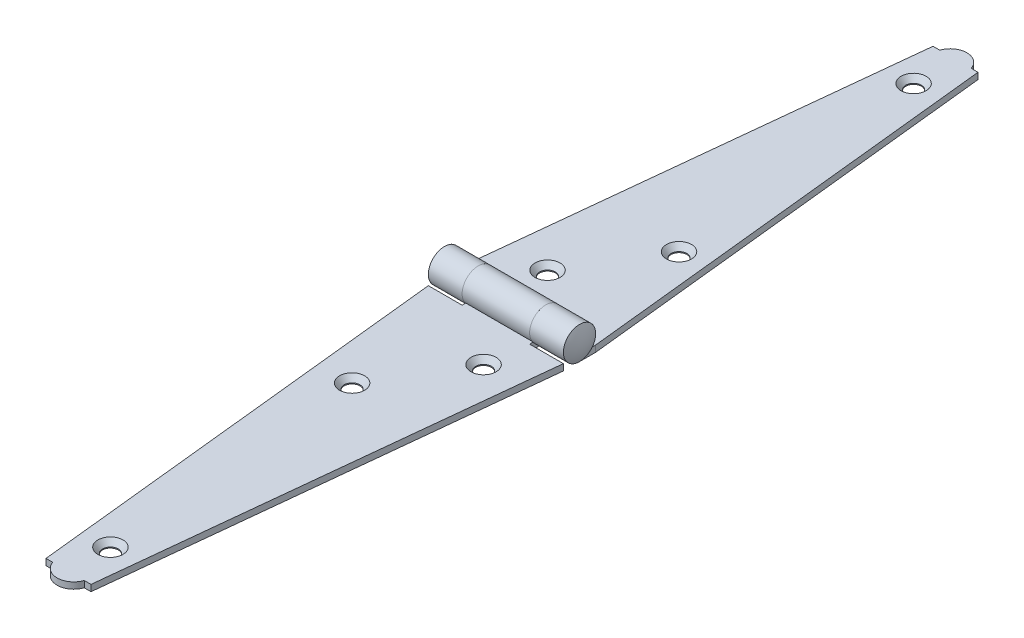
ISO-10303-21;
HEADER;
FILE_DESCRIPTION(('STEP AP214'),'2;1');
FILE_NAME('part.step','',(''),(''),'','','');
FILE_SCHEMA(('AUTOMOTIVE_DESIGN { 1 0 10303 214 1 1 1 1 }'));
ENDSEC;
DATA;
#1=APPLICATION_CONTEXT('core data for automotive mechanical design processes');
#2=APPLICATION_PROTOCOL_DEFINITION('international standard','automotive_design',2000,#1);
#3=PRODUCT_CONTEXT('',#1,'mechanical');
#4=PRODUCT('Part','Part','',(#3));
#5=PRODUCT_RELATED_PRODUCT_CATEGORY('part','',(#4));
#6=PRODUCT_DEFINITION_FORMATION('','',#4);
#7=PRODUCT_DEFINITION_CONTEXT('part definition',#1,'design');
#8=PRODUCT_DEFINITION('design','',#6,#7);
#9=PRODUCT_DEFINITION_SHAPE('','',#8);
#10=(LENGTH_UNIT() NAMED_UNIT(*) SI_UNIT(.MILLI.,.METRE.));
#11=(NAMED_UNIT(*) PLANE_ANGLE_UNIT() SI_UNIT($,.RADIAN.));
#12=(NAMED_UNIT(*) SI_UNIT($,.STERADIAN.) SOLID_ANGLE_UNIT());
#13=UNCERTAINTY_MEASURE_WITH_UNIT(LENGTH_MEASURE(1.E-05),#10,'distance_accuracy_value','');
#14=(GEOMETRIC_REPRESENTATION_CONTEXT(3) GLOBAL_UNCERTAINTY_ASSIGNED_CONTEXT((#13)) GLOBAL_UNIT_ASSIGNED_CONTEXT((#10,
#11,#12)) REPRESENTATION_CONTEXT('',''));
#15=CARTESIAN_POINT('',(0.,0.,0.));
#16=DIRECTION('',(0.,0.,1.));
#17=DIRECTION('',(1.,0.,0.));
#18=AXIS2_PLACEMENT_3D('',#15,#16,#17);
#19=CARTESIAN_POINT('',(6.93366917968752,3.60521250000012,0.));
#20=DIRECTION('',(1.,0.,0.));
#21=DIRECTION('',(0.,0.,1.));
#22=AXIS2_PLACEMENT_3D('',#19,#20,#21);
#23=SPHERICAL_SURFACE('',#22,8.90958082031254);
#24=CARTESIAN_POINT('',(15.0812499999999,3.60521249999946,-1.11022302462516E-13));
#25=DIRECTION('',(1.,0.,0.));
#26=DIRECTION('',(0.,0.,-1.));
#27=AXIS2_PLACEMENT_3D('',#24,#25,#26);
#28=CIRCLE('',#27,3.60521250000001);
#29=CARTESIAN_POINT('',(15.0812499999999,3.60521249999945,-3.60521250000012));
#30=VERTEX_POINT('',#29);
#31=EDGE_CURVE('E11',#30,#30,#28,.T.);
#32=ORIENTED_EDGE('',*,*,#31,.T.);
#33=EDGE_LOOP('',(#32));
#34=FACE_BOUND('',#33,.T.);
#35=ADVANCED_FACE('F41',(#34),#23,.T.);
#36=CARTESIAN_POINT('',(15.0812499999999,3.60521250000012,-3.60521249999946));
#37=DIRECTION('',(-1.,0.,0.));
#38=DIRECTION('',(0.,0.,1.));
#39=AXIS2_PLACEMENT_3D('',#36,#37,#38);
#40=PLANE('',#39);
#41=CARTESIAN_POINT('',(15.0812499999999,3.60521249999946,-1.11022302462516E-13));
#42=DIRECTION('',(1.,0.,0.));
#43=DIRECTION('',(0.,0.,-1.));
#44=AXIS2_PLACEMENT_3D('',#41,#42,#43);
#45=CIRCLE('',#44,2.18281249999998);
#46=CARTESIAN_POINT('',(15.0812499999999,3.60521249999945,-2.18281250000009));
#47=VERTEX_POINT('',#46);
#48=EDGE_CURVE('E47',#47,#47,#45,.T.);
#49=ORIENTED_EDGE('',*,*,#48,.T.);
#50=EDGE_LOOP('',(#49));
#51=FACE_BOUND('',#50,.T.);
#52=ORIENTED_EDGE('',*,*,#31,.F.);
#53=EDGE_LOOP('',(#52));
#54=FACE_BOUND('',#53,.T.);
#55=ADVANCED_FACE('F73',(#51,#54),#40,.T.);
#56=CARTESIAN_POINT('',(15.8432500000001,3.60521250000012,0.));
#57=DIRECTION('',(1.,0.,0.));
#58=DIRECTION('',(0.,0.,-1.));
#59=AXIS2_PLACEMENT_3D('',#56,#57,#58);
#60=CYLINDRICAL_SURFACE('',#59,2.18281249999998);
#61=CARTESIAN_POINT('',(-15.0812499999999,3.60521250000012,0.));
#62=DIRECTION('',(1.,0.,0.));
#63=DIRECTION('',(0.,0.,-1.));
#64=AXIS2_PLACEMENT_3D('',#61,#62,#63);
#65=CIRCLE('',#64,2.18281249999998);
#66=CARTESIAN_POINT('',(-15.0812499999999,3.60521250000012,-2.18281249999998));
#67=VERTEX_POINT('',#66);
#68=EDGE_CURVE('E51',#67,#67,#65,.T.);
#69=ORIENTED_EDGE('',*,*,#68,.T.);
#70=EDGE_LOOP('',(#69));
#71=FACE_BOUND('',#70,.T.);
#72=ORIENTED_EDGE('',*,*,#48,.F.);
#73=EDGE_LOOP('',(#72));
#74=FACE_BOUND('',#73,.T.);
#75=ADVANCED_FACE('F70',(#71,#74),#60,.T.);
#76=CARTESIAN_POINT('',(-15.0812499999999,3.60521250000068,-2.18281249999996));
#77=DIRECTION('',(1.,0.,0.));
#78=DIRECTION('',(0.,0.,-1.));
#79=AXIS2_PLACEMENT_3D('',#76,#77,#78);
#80=PLANE('',#79);
#81=CARTESIAN_POINT('',(-15.0812499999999,3.60521250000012,0.));
#82=DIRECTION('',(1.,0.,0.));
#83=DIRECTION('',(0.,0.,-1.));
#84=AXIS2_PLACEMENT_3D('',#81,#82,#83);
#85=CIRCLE('',#84,3.6052125);
#86=CARTESIAN_POINT('',(-15.0812499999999,3.60521250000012,-3.60521250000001));
#87=VERTEX_POINT('',#86);
#88=EDGE_CURVE('E55',#87,#87,#85,.T.);
#89=ORIENTED_EDGE('',*,*,#88,.T.);
#90=EDGE_LOOP('',(#89));
#91=FACE_BOUND('',#90,.T.);
#92=ORIENTED_EDGE('',*,*,#68,.F.);
#93=EDGE_LOOP('',(#92));
#94=FACE_BOUND('',#93,.T.);
#95=ADVANCED_FACE('F61',(#91,#94),#80,.T.);
#96=CARTESIAN_POINT('',(-6.93366917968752,3.60521249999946,-1.11022302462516E-13));
#97=DIRECTION('',(1.,0.,0.));
#98=DIRECTION('',(0.,0.,-1.));
#99=AXIS2_PLACEMENT_3D('',#96,#97,#98);
#100=SPHERICAL_SURFACE('',#99,8.90958082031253);
#101=ORIENTED_EDGE('',*,*,#88,.F.);
#102=EDGE_LOOP('',(#101));
#103=FACE_BOUND('',#102,.T.);
#104=ADVANCED_FACE('F64',(#103),#100,.T.);
#105=CLOSED_SHELL('',(#35,#55,#75,#95,#104));
#106=MANIFOLD_SOLID_BREP('B2',#105);
#107=CARTESIAN_POINT('',(120.533262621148,3.60521250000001,3.33066907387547E-13));
#108=DIRECTION('',(-1.,0.,0.));
#109=DIRECTION('',(0.,0.,1.));
#110=AXIS2_PLACEMENT_3D('',#107,#108,#109);
#111=CYLINDRICAL_SURFACE('',#110,3.60521250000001);
#112=CARTESIAN_POINT('',(-7.54062500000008,3.6052124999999,1.11022302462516E-13));
#113=DIRECTION('',(1.,0.,0.));
#114=DIRECTION('',(0.,0.,-1.));
#115=AXIS2_PLACEMENT_3D('',#112,#113,#114);
#116=CIRCLE('',#115,3.60521250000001);
#117=CARTESIAN_POINT('',(-7.54062500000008,1.67639999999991,-3.04585612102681));
#118=VERTEX_POINT('',#117);
#119=CARTESIAN_POINT('',(-7.54062500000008,0.,0.));
#120=VERTEX_POINT('',#119);
#121=EDGE_CURVE('E295',#118,#120,#116,.T.);
#122=ORIENTED_EDGE('',*,*,#121,.F.);
#123=DIRECTION('',(-1.,0.,0.));
#124=VECTOR('',#123,1.);
#125=CARTESIAN_POINT('',(120.533262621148,1.67639999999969,-3.04585612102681));
#126=LINE('',#125,#124);
#127=CARTESIAN_POINT('',(-15.0812499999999,1.67639999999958,-3.04585612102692));
#128=VERTEX_POINT('',#127);
#129=EDGE_CURVE('E311',#118,#128,#126,.T.);
#130=ORIENTED_EDGE('',*,*,#129,.T.);
#131=CARTESIAN_POINT('',(-15.0812499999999,3.60521250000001,0.));
#132=DIRECTION('',(1.,0.,0.));
#133=DIRECTION('',(0.,0.,-1.));
#134=AXIS2_PLACEMENT_3D('',#131,#132,#133);
#135=CIRCLE('',#134,3.60521250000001);
#136=CARTESIAN_POINT('',(-15.0812499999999,-3.33066907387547E-13,1.11022302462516E-13));
#137=VERTEX_POINT('',#136);
#138=EDGE_CURVE('E306',#137,#128,#135,.F.);
#139=ORIENTED_EDGE('',*,*,#138,.F.);
#140=DIRECTION('',(-1.,0.,0.));
#141=VECTOR('',#140,1.);
#142=CARTESIAN_POINT('',(120.533262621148,-2.22044604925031E-13,6.66133814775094E-13));
#143=LINE('',#142,#141);
#144=EDGE_CURVE('E332',#120,#137,#143,.T.);
#145=ORIENTED_EDGE('',*,*,#144,.F.);
#146=EDGE_LOOP('',(#122,#130,#139,#145));
#147=FACE_BOUND('',#146,.T.);
#148=ADVANCED_FACE('F110',(#147),#111,.T.);
#149=CARTESIAN_POINT('',(15.0812499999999,1.67639999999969,-3.0458561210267));
#150=VERTEX_POINT('',#149);
#151=CARTESIAN_POINT('',(7.54062500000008,1.6763999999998,-3.0458561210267));
#152=VERTEX_POINT('',#151);
#153=EDGE_CURVE('E339',#150,#152,#126,.T.);
#154=ORIENTED_EDGE('',*,*,#153,.T.);
#155=CARTESIAN_POINT('',(7.54062500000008,3.60521250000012,0.));
#156=DIRECTION('',(-1.,0.,0.));
#157=DIRECTION('',(0.,0.,1.));
#158=AXIS2_PLACEMENT_3D('',#155,#156,#157);
#159=CIRCLE('',#158,3.60521250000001);
#160=CARTESIAN_POINT('',(7.54062500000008,-5.55111512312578E-13,2.22044604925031E-13));
#161=VERTEX_POINT('',#160);
#162=EDGE_CURVE('E133',#161,#152,#159,.T.);
#163=ORIENTED_EDGE('',*,*,#162,.F.);
#164=CARTESIAN_POINT('',(15.0812499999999,-5.55111512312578E-13,1.11022302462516E-13));
#165=VERTEX_POINT('',#164);
#166=EDGE_CURVE('E328',#165,#161,#143,.T.);
#167=ORIENTED_EDGE('',*,*,#166,.F.);
#168=CARTESIAN_POINT('',(15.0812499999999,3.60521250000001,0.));
#169=DIRECTION('',(1.,0.,0.));
#170=DIRECTION('',(0.,0.,-1.));
#171=AXIS2_PLACEMENT_3D('',#168,#169,#170);
#172=CIRCLE('',#171,3.60521250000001);
#173=EDGE_CURVE('E321',#150,#165,#172,.T.);
#174=ORIENTED_EDGE('',*,*,#173,.F.);
#175=EDGE_LOOP('',(#154,#163,#167,#174));
#176=FACE_BOUND('',#175,.T.);
#177=ADVANCED_FACE('F382',(#176),#111,.T.);
#178=CARTESIAN_POINT('',(120.533262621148,-2.22044604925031E-13,6.66133814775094E-13));
#179=DIRECTION('',(0.,1.,0.));
#180=DIRECTION('',(0.,0.,1.));
#181=AXIS2_PLACEMENT_3D('',#178,#179,#180);
#182=PLANE('',#181);
#183=CARTESIAN_POINT('',(-6.66133814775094E-13,0.,-89.69375));
#184=DIRECTION('',(0.,1.,0.));
#185=DIRECTION('',(0.,0.,1.));
#186=AXIS2_PLACEMENT_3D('',#183,#184,#185);
#187=CIRCLE('',#186,1.7526);
#188=CARTESIAN_POINT('',(-6.62558805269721E-13,0.,-87.94115));
#189=VERTEX_POINT('',#188);
#190=EDGE_CURVE('E235',#189,#189,#187,.T.);
#191=ORIENTED_EDGE('',*,*,#190,.T.);
#192=EDGE_LOOP('',(#191));
#193=FACE_BOUND('',#192,.T.);
#194=CARTESIAN_POINT('',(6.35000000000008,-3.33066907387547E-13,-30.95625));
#195=DIRECTION('',(0.,1.,0.));
#196=DIRECTION('',(0.,0.,1.));
#197=AXIS2_PLACEMENT_3D('',#194,#195,#196);
#198=CIRCLE('',#197,1.7526);
#199=CARTESIAN_POINT('',(6.35000000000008,-3.317535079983E-13,-29.20365));
#200=VERTEX_POINT('',#199);
#201=EDGE_CURVE('E472',#200,#200,#198,.T.);
#202=ORIENTED_EDGE('',*,*,#201,.T.);
#203=EDGE_LOOP('',(#202));
#204=FACE_BOUND('',#203,.T.);
#205=CARTESIAN_POINT('',(-4.7625,1.11022302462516E-13,-12.6999999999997));
#206=DIRECTION('',(0.,1.,0.));
#207=DIRECTION('',(0.,0.,1.));
#208=AXIS2_PLACEMENT_3D('',#205,#206,#207);
#209=CIRCLE('',#208,1.7526);
#210=CARTESIAN_POINT('',(-4.7625,1.12335701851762E-13,-10.9473999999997));
#211=VERTEX_POINT('',#210);
#212=EDGE_CURVE('E474',#211,#211,#209,.T.);
#213=ORIENTED_EDGE('',*,*,#212,.T.);
#214=EDGE_LOOP('',(#213));
#215=FACE_BOUND('',#214,.T.);
#216=DIRECTION('',(0.,0.,1.));
#217=VECTOR('',#216,1.);
#218=CARTESIAN_POINT('',(-15.0812499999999,-3.33066907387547E-13,1.11022302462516E-13));
#219=LINE('',#218,#217);
#220=CARTESIAN_POINT('',(-15.0812499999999,-3.33066907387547E-13,-3.60521249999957));
#221=VERTEX_POINT('',#220);
#222=EDGE_CURVE('E309',#221,#137,#219,.T.);
#223=ORIENTED_EDGE('',*,*,#222,.F.);
#224=DIRECTION('',(0.104749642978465,0.,-0.994498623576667));
#225=VECTOR('',#224,1.);
#226=CARTESIAN_POINT('',(-13.9687885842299,0.,-14.1669797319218));
#227=LINE('',#226,#225);
#228=CARTESIAN_POINT('',(-5.0270833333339,-4.44089209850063E-13,-99.0599999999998));
#229=VERTEX_POINT('',#228);
#230=EDGE_CURVE('E125',#221,#229,#227,.T.);
#231=ORIENTED_EDGE('',*,*,#230,.T.);
#232=DIRECTION('',(1.,0.,0.));
#233=VECTOR('',#232,1.);
#234=CARTESIAN_POINT('',(120.533262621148,-1.11022302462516E-13,-99.06));
#235=LINE('',#234,#233);
#236=CARTESIAN_POINT('',(-3.51895833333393,-3.33066907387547E-13,-99.06));
#237=VERTEX_POINT('',#236);
#238=EDGE_CURVE('E270',#229,#237,#235,.T.);
#239=ORIENTED_EDGE('',*,*,#238,.T.);
#240=CARTESIAN_POINT('',(-6.66133814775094E-13,-6.66133814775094E-13,-97.8923882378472));
#241=DIRECTION('',(0.,1.,0.));
#242=DIRECTION('',(0.,0.,1.));
#243=AXIS2_PLACEMENT_3D('',#240,#241,#242);
#244=CIRCLE('',#243,3.70761176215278);
#245=CARTESIAN_POINT('',(3.51895833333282,0.,-99.0599999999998));
#246=VERTEX_POINT('',#245);
#247=EDGE_CURVE('E267',#237,#246,#244,.F.);
#248=ORIENTED_EDGE('',*,*,#247,.T.);
#249=DIRECTION('',(1.,0.,0.));
#250=VECTOR('',#249,1.);
#251=CARTESIAN_POINT('',(120.533262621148,-1.11022302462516E-13,-99.06));
#252=LINE('',#251,#250);
#253=CARTESIAN_POINT('',(5.02708333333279,-3.33066907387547E-13,-99.06));
#254=VERTEX_POINT('',#253);
#255=EDGE_CURVE('E244',#246,#254,#252,.T.);
#256=ORIENTED_EDGE('',*,*,#255,.T.);
#257=DIRECTION('',(0.104749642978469,0.,0.994498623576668));
#258=VECTOR('',#257,1.);
#259=CARTESIAN_POINT('',(16.6138880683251,-4.44089209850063E-13,10.9457339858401));
#260=LINE('',#259,#258);
#261=CARTESIAN_POINT('',(15.0812499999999,-5.55111512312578E-13,-3.60521249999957));
#262=VERTEX_POINT('',#261);
#263=EDGE_CURVE('E264',#254,#262,#260,.T.);
#264=ORIENTED_EDGE('',*,*,#263,.T.);
#265=DIRECTION('',(0.,0.,-1.));
#266=VECTOR('',#265,1.);
#267=CARTESIAN_POINT('',(15.0812499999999,-5.55111512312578E-13,1.11022302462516E-13));
#268=LINE('',#267,#266);
#269=EDGE_CURVE('E318',#165,#262,#268,.T.);
#270=ORIENTED_EDGE('',*,*,#269,.F.);
#271=ORIENTED_EDGE('',*,*,#166,.T.);
#272=DIRECTION('',(0.,0.,-1.));
#273=VECTOR('',#272,1.);
#274=CARTESIAN_POINT('',(7.54062500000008,-2.22044604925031E-13,-3.60521249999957));
#275=LINE('',#274,#273);
#276=CARTESIAN_POINT('',(7.54062500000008,-2.22044604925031E-13,-3.60521249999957));
#277=VERTEX_POINT('',#276);
#278=EDGE_CURVE('E276',#161,#277,#275,.T.);
#279=ORIENTED_EDGE('',*,*,#278,.T.);
#280=DIRECTION('',(-1.,0.,0.));
#281=VECTOR('',#280,1.);
#282=CARTESIAN_POINT('',(-7.54062500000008,-4.44089209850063E-13,-3.60521249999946));
#283=LINE('',#282,#281);
#284=CARTESIAN_POINT('',(-7.54062500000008,-4.44089209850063E-13,-3.60521249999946));
#285=VERTEX_POINT('',#284);
#286=EDGE_CURVE('E279',#277,#285,#283,.T.);
#287=ORIENTED_EDGE('',*,*,#286,.T.);
#288=DIRECTION('',(0.,0.,1.));
#289=VECTOR('',#288,1.);
#290=CARTESIAN_POINT('',(-7.54062500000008,-4.44089209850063E-13,-3.60521249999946));
#291=LINE('',#290,#289);
#292=EDGE_CURVE('E273',#285,#120,#291,.T.);
#293=ORIENTED_EDGE('',*,*,#292,.T.);
#294=ORIENTED_EDGE('',*,*,#144,.T.);
#295=EDGE_LOOP('',(#223,#231,#239,#248,#256,#264,#270,#271,#279,#287,#293,#294));
#296=FACE_BOUND('',#295,.T.);
#297=ADVANCED_FACE('F388',(#193,#204,#215,#296),#182,.F.);
#298=CARTESIAN_POINT('',(120.533262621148,1.42240000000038,-101.6));
#299=DIRECTION('',(0.,-1.,0.));
#300=DIRECTION('',(0.,0.,-1.));
#301=AXIS2_PLACEMENT_3D('',#298,#299,#300);
#302=PLANE('',#301);
#303=CARTESIAN_POINT('',(-4.7625,1.4223999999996,-12.6999999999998));
#304=DIRECTION('',(0.,-1.,0.));
#305=DIRECTION('',(0.,0.,-1.));
#306=AXIS2_PLACEMENT_3D('',#303,#304,#305);
#307=CIRCLE('',#306,2.80360243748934);
#308=CARTESIAN_POINT('',(-4.76250000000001,1.4223999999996,-15.5036024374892));
#309=VERTEX_POINT('',#308);
#310=EDGE_CURVE('E361',#309,#309,#307,.T.);
#311=ORIENTED_EDGE('',*,*,#310,.T.);
#312=EDGE_LOOP('',(#311));
#313=FACE_BOUND('',#312,.T.);
#314=CARTESIAN_POINT('',(-6.66133814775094E-13,1.42240000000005,-89.69375));
#315=DIRECTION('',(0.,-1.,0.));
#316=DIRECTION('',(0.,0.,-1.));
#317=AXIS2_PLACEMENT_3D('',#314,#315,#316);
#318=CIRCLE('',#317,2.80360243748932);
#319=CARTESIAN_POINT('',(-6.71852692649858E-13,1.42240000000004,-92.4973524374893));
#320=VERTEX_POINT('',#319);
#321=EDGE_CURVE('E358',#320,#320,#318,.T.);
#322=ORIENTED_EDGE('',*,*,#321,.T.);
#323=EDGE_LOOP('',(#322));
#324=FACE_BOUND('',#323,.T.);
#325=CARTESIAN_POINT('',(6.35000000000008,1.4223999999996,-30.9562499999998));
#326=DIRECTION('',(0.,-1.,0.));
#327=DIRECTION('',(0.,0.,-1.));
#328=AXIS2_PLACEMENT_3D('',#325,#326,#327);
#329=CIRCLE('',#328,2.80360243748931);
#330=CARTESIAN_POINT('',(6.35000000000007,1.4223999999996,-33.7598524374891));
#331=VERTEX_POINT('',#330);
#332=EDGE_CURVE('E355',#331,#331,#329,.T.);
#333=ORIENTED_EDGE('',*,*,#332,.T.);
#334=EDGE_LOOP('',(#333));
#335=FACE_BOUND('',#334,.T.);
#336=DIRECTION('',(1.,0.,0.));
#337=VECTOR('',#336,1.);
#338=CARTESIAN_POINT('',(-3.51895833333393,1.4223999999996,-99.0599999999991));
#339=LINE('',#338,#337);
#340=CARTESIAN_POINT('',(-5.0270833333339,1.42239999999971,-99.0599999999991));
#341=VERTEX_POINT('',#340);
#342=CARTESIAN_POINT('',(-3.51895833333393,1.4223999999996,-99.0599999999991));
#343=VERTEX_POINT('',#342);
#344=EDGE_CURVE('E246',#341,#343,#339,.T.);
#345=ORIENTED_EDGE('',*,*,#344,.F.);
#346=DIRECTION('',(0.104749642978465,0.,-0.994498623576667));
#347=VECTOR('',#346,1.);
#348=CARTESIAN_POINT('',(-5.0270833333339,1.42239999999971,-99.0599999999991));
#349=LINE('',#348,#347);
#350=CARTESIAN_POINT('',(-15.0812499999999,1.42239999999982,-3.60521250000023));
#351=VERTEX_POINT('',#350);
#352=EDGE_CURVE('E252',#351,#341,#349,.T.);
#353=ORIENTED_EDGE('',*,*,#352,.F.);
#354=DIRECTION('',(0.,0.,-1.));
#355=VECTOR('',#354,1.);
#356=CARTESIAN_POINT('',(-15.0812500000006,1.42239999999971,-101.6));
#357=LINE('',#356,#355);
#358=CARTESIAN_POINT('',(-15.0812499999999,1.42239999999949,3.33066907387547E-13));
#359=VERTEX_POINT('',#358);
#360=EDGE_CURVE('E297',#359,#351,#357,.T.);
#361=ORIENTED_EDGE('',*,*,#360,.F.);
#362=DIRECTION('',(-1.,0.,0.));
#363=VECTOR('',#362,1.);
#364=CARTESIAN_POINT('',(120.533262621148,1.42239999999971,6.66133814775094E-13));
#365=LINE('',#364,#363);
#366=CARTESIAN_POINT('',(-7.54062500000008,1.42239999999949,3.33066907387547E-13));
#367=VERTEX_POINT('',#366);
#368=EDGE_CURVE('E331',#367,#359,#365,.T.);
#369=ORIENTED_EDGE('',*,*,#368,.F.);
#370=DIRECTION('',(0.,0.,1.));
#371=VECTOR('',#370,1.);
#372=CARTESIAN_POINT('',(-7.54062500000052,1.42239999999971,-101.6));
#373=LINE('',#372,#371);
#374=CARTESIAN_POINT('',(-7.54062500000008,1.42240000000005,-3.60521250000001));
#375=VERTEX_POINT('',#374);
#376=EDGE_CURVE('E293',#375,#367,#373,.T.);
#377=ORIENTED_EDGE('',*,*,#376,.F.);
#378=DIRECTION('',(-1.,0.,0.));
#379=VECTOR('',#378,1.);
#380=CARTESIAN_POINT('',(120.533262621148,1.42239999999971,-3.60521250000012));
#381=LINE('',#380,#379);
#382=CARTESIAN_POINT('',(7.54062500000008,1.42239999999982,-3.60521250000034));
#383=VERTEX_POINT('',#382);
#384=EDGE_CURVE('E346',#383,#375,#381,.T.);
#385=ORIENTED_EDGE('',*,*,#384,.F.);
#386=DIRECTION('',(0.,0.,-1.));
#387=VECTOR('',#386,1.);
#388=CARTESIAN_POINT('',(7.54062499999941,1.4223999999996,-101.6));
#389=LINE('',#388,#387);
#390=CARTESIAN_POINT('',(7.54062500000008,1.42239999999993,0.));
#391=VERTEX_POINT('',#390);
#392=EDGE_CURVE('E288',#391,#383,#389,.T.);
#393=ORIENTED_EDGE('',*,*,#392,.F.);
#394=CARTESIAN_POINT('',(15.0812499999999,1.4223999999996,1.11022302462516E-13));
#395=VERTEX_POINT('',#394);
#396=EDGE_CURVE('E333',#395,#391,#365,.T.);
#397=ORIENTED_EDGE('',*,*,#396,.F.);
#398=DIRECTION('',(0.,0.,1.));
#399=VECTOR('',#398,1.);
#400=CARTESIAN_POINT('',(15.0812499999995,1.42239999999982,-101.6));
#401=LINE('',#400,#399);
#402=CARTESIAN_POINT('',(15.0812499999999,1.42239999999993,-3.60521250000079));
#403=VERTEX_POINT('',#402);
#404=EDGE_CURVE('E316',#403,#395,#401,.T.);
#405=ORIENTED_EDGE('',*,*,#404,.F.);
#406=DIRECTION('',(0.104749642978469,0.,0.994498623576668));
#407=VECTOR('',#406,1.);
#408=CARTESIAN_POINT('',(15.0812499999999,1.42239999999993,-3.60521250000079));
#409=LINE('',#408,#407);
#410=CARTESIAN_POINT('',(5.02708333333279,1.42239999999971,-99.0599999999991));
#411=VERTEX_POINT('',#410);
#412=EDGE_CURVE('E250',#411,#403,#409,.T.);
#413=ORIENTED_EDGE('',*,*,#412,.F.);
#414=DIRECTION('',(1.,0.,0.));
#415=VECTOR('',#414,1.);
#416=CARTESIAN_POINT('',(3.51895833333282,1.4223999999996,-99.0599999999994));
#417=LINE('',#416,#415);
#418=CARTESIAN_POINT('',(3.51895833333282,1.4223999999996,-99.0599999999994));
#419=VERTEX_POINT('',#418);
#420=EDGE_CURVE('E234',#419,#411,#417,.T.);
#421=ORIENTED_EDGE('',*,*,#420,.F.);
#422=CARTESIAN_POINT('',(-6.66133814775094E-13,1.42239999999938,-97.8923882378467));
#423=DIRECTION('',(0.,-1.,0.));
#424=DIRECTION('',(0.,0.,-1.));
#425=AXIS2_PLACEMENT_3D('',#422,#423,#424);
#426=CIRCLE('',#425,3.70761176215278);
#427=EDGE_CURVE('E224',#343,#419,#426,.T.);
#428=ORIENTED_EDGE('',*,*,#427,.F.);
#429=EDGE_LOOP('',(#345,#353,#361,#369,#377,#385,#393,#397,#405,#413,#421,#428));
#430=FACE_BOUND('',#429,.T.);
#431=ADVANCED_FACE('F248',(#313,#324,#335,#430),#302,.F.);
#432=CARTESIAN_POINT('',(120.533262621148,3.60521250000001,3.33066907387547E-13));
#433=DIRECTION('',(-1.,0.,0.));
#434=DIRECTION('',(0.,0.,1.));
#435=AXIS2_PLACEMENT_3D('',#432,#433,#434);
#436=CYLINDRICAL_SURFACE('',#435,2.18281249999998);
#437=CARTESIAN_POINT('',(-7.54062500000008,3.6052124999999,1.11022302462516E-13));
#438=DIRECTION('',(1.,0.,0.));
#439=DIRECTION('',(0.,0.,-1.));
#440=AXIS2_PLACEMENT_3D('',#437,#438,#439);
#441=CIRCLE('',#440,2.18281249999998);
#442=CARTESIAN_POINT('',(-7.54062500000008,2.43739339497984,-1.84414450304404));
#443=VERTEX_POINT('',#442);
#444=EDGE_CURVE('E291',#367,#443,#441,.F.);
#445=ORIENTED_EDGE('',*,*,#444,.F.);
#446=ORIENTED_EDGE('',*,*,#368,.T.);
#447=CARTESIAN_POINT('',(-15.0812499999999,3.60521250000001,0.));
#448=DIRECTION('',(1.,0.,0.));
#449=DIRECTION('',(0.,0.,-1.));
#450=AXIS2_PLACEMENT_3D('',#447,#448,#449);
#451=CIRCLE('',#450,2.18281249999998);
#452=CARTESIAN_POINT('',(-15.0812499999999,2.43739339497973,-1.84414450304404));
#453=VERTEX_POINT('',#452);
#454=EDGE_CURVE('E300',#453,#359,#451,.T.);
#455=ORIENTED_EDGE('',*,*,#454,.F.);
#456=DIRECTION('',(-1.,0.,0.));
#457=VECTOR('',#456,1.);
#458=CARTESIAN_POINT('',(120.533262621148,2.43739339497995,-1.84414450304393));
#459=LINE('',#458,#457);
#460=EDGE_CURVE('E336',#443,#453,#459,.T.);
#461=ORIENTED_EDGE('',*,*,#460,.F.);
#462=EDGE_LOOP('',(#445,#446,#455,#461));
#463=FACE_BOUND('',#462,.T.);
#464=ADVANCED_FACE('F450',(#463),#436,.F.);
#465=CARTESIAN_POINT('',(7.54062500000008,3.60521250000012,0.));
#466=DIRECTION('',(-1.,0.,0.));
#467=DIRECTION('',(0.,0.,1.));
#468=AXIS2_PLACEMENT_3D('',#465,#466,#467);
#469=CIRCLE('',#468,2.18281249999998);
#470=CARTESIAN_POINT('',(7.54062500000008,2.43739339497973,-1.84414450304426));
#471=VERTEX_POINT('',#470);
#472=EDGE_CURVE('E286',#471,#391,#469,.F.);
#473=ORIENTED_EDGE('',*,*,#472,.F.);
#474=CARTESIAN_POINT('',(15.0812499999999,2.43739339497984,-1.84414450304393));
#475=VERTEX_POINT('',#474);
#476=EDGE_CURVE('E327',#475,#471,#459,.T.);
#477=ORIENTED_EDGE('',*,*,#476,.F.);
#478=CARTESIAN_POINT('',(15.0812499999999,3.60521250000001,0.));
#479=DIRECTION('',(1.,0.,0.));
#480=DIRECTION('',(0.,0.,-1.));
#481=AXIS2_PLACEMENT_3D('',#478,#479,#480);
#482=CIRCLE('',#481,2.18281249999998);
#483=EDGE_CURVE('E312',#395,#475,#482,.F.);
#484=ORIENTED_EDGE('',*,*,#483,.F.);
#485=ORIENTED_EDGE('',*,*,#396,.T.);
#486=EDGE_LOOP('',(#473,#477,#484,#485));
#487=FACE_BOUND('',#486,.T.);
#488=ADVANCED_FACE('F416',(#487),#436,.F.);
#489=CARTESIAN_POINT('',(120.533262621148,1.67639999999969,-3.04585612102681));
#490=DIRECTION('',(0.,0.844847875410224,-0.535006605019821));
#491=DIRECTION('',(0.,0.535006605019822,0.844847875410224));
#492=AXIS2_PLACEMENT_3D('',#489,#490,#491);
#493=PLANE('',#492);
#494=DIRECTION('',(0.,-0.535006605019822,-0.844847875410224));
#495=VECTOR('',#494,1.);
#496=CARTESIAN_POINT('',(-7.54062500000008,1.67639999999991,-3.04585612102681));
#497=LINE('',#496,#495);
#498=EDGE_CURVE('E343',#443,#118,#497,.T.);
#499=ORIENTED_EDGE('',*,*,#498,.F.);
#500=ORIENTED_EDGE('',*,*,#460,.T.);
#501=DIRECTION('',(0.,0.535006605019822,0.844847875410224));
#502=VECTOR('',#501,1.);
#503=CARTESIAN_POINT('',(-15.0812499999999,1.67639999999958,-3.04585612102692));
#504=LINE('',#503,#502);
#505=EDGE_CURVE('E303',#128,#453,#504,.T.);
#506=ORIENTED_EDGE('',*,*,#505,.F.);
#507=ORIENTED_EDGE('',*,*,#129,.F.);
#508=EDGE_LOOP('',(#499,#500,#506,#507));
#509=FACE_BOUND('',#508,.T.);
#510=ADVANCED_FACE('F405',(#509),#493,.F.);
#511=DIRECTION('',(0.,0.535006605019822,0.844847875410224));
#512=VECTOR('',#511,1.);
#513=CARTESIAN_POINT('',(7.54062500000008,1.6763999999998,-3.0458561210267));
#514=LINE('',#513,#512);
#515=EDGE_CURVE('E315',#152,#471,#514,.T.);
#516=ORIENTED_EDGE('',*,*,#515,.F.);
#517=ORIENTED_EDGE('',*,*,#153,.F.);
#518=DIRECTION('',(0.,-0.535006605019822,-0.844847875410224));
#519=VECTOR('',#518,1.);
#520=CARTESIAN_POINT('',(15.0812499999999,1.67639999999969,-3.0458561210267));
#521=LINE('',#520,#519);
#522=EDGE_CURVE('E324',#475,#150,#521,.T.);
#523=ORIENTED_EDGE('',*,*,#522,.F.);
#524=ORIENTED_EDGE('',*,*,#476,.T.);
#525=EDGE_LOOP('',(#516,#517,#523,#524));
#526=FACE_BOUND('',#525,.T.);
#527=ADVANCED_FACE('F396',(#526),#493,.F.);
#528=CARTESIAN_POINT('',(15.0812499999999,3.60521250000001,0.));
#529=DIRECTION('',(1.,0.,0.));
#530=DIRECTION('',(0.,0.,-1.));
#531=AXIS2_PLACEMENT_3D('',#528,#529,#530);
#532=PLANE('',#531);
#533=DIRECTION('',(0.,-1.,0.));
#534=VECTOR('',#533,1.);
#535=CARTESIAN_POINT('',(15.0812499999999,3.60521250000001,-3.60521249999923));
#536=LINE('',#535,#534);
#537=EDGE_CURVE('E350',#403,#262,#536,.T.);
#538=ORIENTED_EDGE('',*,*,#537,.F.);
#539=ORIENTED_EDGE('',*,*,#404,.T.);
#540=ORIENTED_EDGE('',*,*,#483,.T.);
#541=ORIENTED_EDGE('',*,*,#522,.T.);
#542=ORIENTED_EDGE('',*,*,#173,.T.);
#543=ORIENTED_EDGE('',*,*,#269,.T.);
#544=EDGE_LOOP('',(#538,#539,#540,#541,#542,#543));
#545=FACE_BOUND('',#544,.T.);
#546=ADVANCED_FACE('F393',(#545),#532,.T.);
#547=CARTESIAN_POINT('',(-15.0812499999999,3.60521250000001,0.));
#548=DIRECTION('',(1.,0.,0.));
#549=DIRECTION('',(0.,0.,-1.));
#550=AXIS2_PLACEMENT_3D('',#547,#548,#549);
#551=PLANE('',#550);
#552=ORIENTED_EDGE('',*,*,#360,.T.);
#553=DIRECTION('',(0.,-1.,0.));
#554=VECTOR('',#553,1.);
#555=CARTESIAN_POINT('',(-15.0812499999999,3.60521250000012,-3.6052124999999));
#556=LINE('',#555,#554);
#557=EDGE_CURVE('E348',#351,#221,#556,.T.);
#558=ORIENTED_EDGE('',*,*,#557,.T.);
#559=ORIENTED_EDGE('',*,*,#222,.T.);
#560=ORIENTED_EDGE('',*,*,#138,.T.);
#561=ORIENTED_EDGE('',*,*,#505,.T.);
#562=ORIENTED_EDGE('',*,*,#454,.T.);
#563=EDGE_LOOP('',(#552,#558,#559,#560,#561,#562));
#564=FACE_BOUND('',#563,.T.);
#565=ADVANCED_FACE('F395',(#564),#551,.F.);
#566=CARTESIAN_POINT('',(-7.54062500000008,7.21042499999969,-3.60521250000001));
#567=DIRECTION('',(0.,0.,1.));
#568=DIRECTION('',(1.,0.,0.));
#569=AXIS2_PLACEMENT_3D('',#566,#567,#568);
#570=PLANE('',#569);
#571=ORIENTED_EDGE('',*,*,#384,.T.);
#572=DIRECTION('',(0.,-1.,0.));
#573=VECTOR('',#572,1.);
#574=CARTESIAN_POINT('',(-7.54062500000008,7.21042499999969,-3.60521250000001));
#575=LINE('',#574,#573);
#576=EDGE_CURVE('E282',#375,#285,#575,.T.);
#577=ORIENTED_EDGE('',*,*,#576,.T.);
#578=ORIENTED_EDGE('',*,*,#286,.F.);
#579=DIRECTION('',(0.,-1.,0.));
#580=VECTOR('',#579,1.);
#581=CARTESIAN_POINT('',(7.54062500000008,7.21042499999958,-3.60521250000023));
#582=LINE('',#581,#580);
#583=EDGE_CURVE('E284',#383,#277,#582,.T.);
#584=ORIENTED_EDGE('',*,*,#583,.F.);
#585=EDGE_LOOP('',(#571,#577,#578,#584));
#586=FACE_BOUND('',#585,.T.);
#587=ADVANCED_FACE('F402',(#586),#570,.T.);
#588=CARTESIAN_POINT('',(-7.54062500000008,7.21042499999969,-3.60521250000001));
#589=DIRECTION('',(1.,0.,0.));
#590=DIRECTION('',(0.,0.,-1.));
#591=AXIS2_PLACEMENT_3D('',#588,#589,#590);
#592=PLANE('',#591);
#593=ORIENTED_EDGE('',*,*,#121,.T.);
#594=ORIENTED_EDGE('',*,*,#292,.F.);
#595=ORIENTED_EDGE('',*,*,#576,.F.);
#596=ORIENTED_EDGE('',*,*,#376,.T.);
#597=ORIENTED_EDGE('',*,*,#444,.T.);
#598=ORIENTED_EDGE('',*,*,#498,.T.);
#599=EDGE_LOOP('',(#593,#594,#595,#596,#597,#598));
#600=FACE_BOUND('',#599,.T.);
#601=ADVANCED_FACE('F440',(#600),#592,.T.);
#602=CARTESIAN_POINT('',(7.54062500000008,7.21042499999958,-3.60521250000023));
#603=DIRECTION('',(-1.,0.,0.));
#604=DIRECTION('',(0.,0.,1.));
#605=AXIS2_PLACEMENT_3D('',#602,#603,#604);
#606=PLANE('',#605);
#607=ORIENTED_EDGE('',*,*,#162,.T.);
#608=ORIENTED_EDGE('',*,*,#515,.T.);
#609=ORIENTED_EDGE('',*,*,#472,.T.);
#610=ORIENTED_EDGE('',*,*,#392,.T.);
#611=ORIENTED_EDGE('',*,*,#583,.T.);
#612=ORIENTED_EDGE('',*,*,#278,.F.);
#613=EDGE_LOOP('',(#607,#608,#609,#610,#611,#612));
#614=FACE_BOUND('',#613,.T.);
#615=ADVANCED_FACE('F442',(#614),#606,.T.);
#616=CARTESIAN_POINT('',(-3.51895833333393,-1054.7096,-99.0600000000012));
#617=DIRECTION('',(0.,0.,1.));
#618=DIRECTION('',(0.,-1.,0.));
#619=AXIS2_PLACEMENT_3D('',#616,#617,#618);
#620=PLANE('',#619);
#621=DIRECTION('',(0.,1.,0.));
#622=VECTOR('',#621,1.);
#623=CARTESIAN_POINT('',(-5.0270833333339,-1054.7096,-99.0600000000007));
#624=LINE('',#623,#622);
#625=EDGE_CURVE('E260',#229,#341,#624,.T.);
#626=ORIENTED_EDGE('',*,*,#625,.T.);
#627=ORIENTED_EDGE('',*,*,#344,.T.);
#628=DIRECTION('',(0.,1.,0.));
#629=VECTOR('',#628,1.);
#630=CARTESIAN_POINT('',(-3.51895833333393,-1054.7096,-99.0600000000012));
#631=LINE('',#630,#629);
#632=EDGE_CURVE('E229',#237,#343,#631,.T.);
#633=ORIENTED_EDGE('',*,*,#632,.F.);
#634=ORIENTED_EDGE('',*,*,#238,.F.);
#635=EDGE_LOOP('',(#626,#627,#633,#634));
#636=FACE_BOUND('',#635,.T.);
#637=ADVANCED_FACE('F436',(#636),#620,.F.);
#638=CARTESIAN_POINT('',(3.51895833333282,-1054.7096,-99.0600000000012));
#639=DIRECTION('',(0.,0.,1.));
#640=DIRECTION('',(0.,-1.,0.));
#641=AXIS2_PLACEMENT_3D('',#638,#639,#640);
#642=PLANE('',#641);
#643=DIRECTION('',(0.,1.,0.));
#644=VECTOR('',#643,1.);
#645=CARTESIAN_POINT('',(3.51895833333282,-1054.7096,-99.0600000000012));
#646=LINE('',#645,#644);
#647=EDGE_CURVE('E227',#246,#419,#646,.T.);
#648=ORIENTED_EDGE('',*,*,#647,.T.);
#649=ORIENTED_EDGE('',*,*,#420,.T.);
#650=DIRECTION('',(0.,1.,0.));
#651=VECTOR('',#650,1.);
#652=CARTESIAN_POINT('',(5.02708333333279,-1054.7096,-99.0600000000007));
#653=LINE('',#652,#651);
#654=EDGE_CURVE('E245',#254,#411,#653,.T.);
#655=ORIENTED_EDGE('',*,*,#654,.F.);
#656=ORIENTED_EDGE('',*,*,#255,.F.);
#657=EDGE_LOOP('',(#648,#649,#655,#656));
#658=FACE_BOUND('',#657,.T.);
#659=ADVANCED_FACE('F240',(#658),#642,.F.);
#660=CARTESIAN_POINT('',(-6.66133814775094E-13,-1054.7096,-97.8923882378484));
#661=DIRECTION('',(0.,1.,0.));
#662=DIRECTION('',(0.,0.,1.));
#663=AXIS2_PLACEMENT_3D('',#660,#661,#662);
#664=CYLINDRICAL_SURFACE('',#663,3.70761176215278);
#665=ORIENTED_EDGE('',*,*,#632,.T.);
#666=ORIENTED_EDGE('',*,*,#427,.T.);
#667=ORIENTED_EDGE('',*,*,#647,.F.);
#668=ORIENTED_EDGE('',*,*,#247,.F.);
#669=EDGE_LOOP('',(#665,#666,#667,#668));
#670=FACE_BOUND('',#669,.T.);
#671=ADVANCED_FACE('F226',(#670),#664,.T.);
#672=CARTESIAN_POINT('',(15.0812499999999,-1054.7096,-3.60521250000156));
#673=DIRECTION('',(-0.994498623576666,0.,0.104749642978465));
#674=DIRECTION('',(0.104749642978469,0.,0.994498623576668));
#675=AXIS2_PLACEMENT_3D('',#672,#673,#674);
#676=PLANE('',#675);
#677=ORIENTED_EDGE('',*,*,#654,.T.);
#678=ORIENTED_EDGE('',*,*,#412,.T.);
#679=ORIENTED_EDGE('',*,*,#537,.T.);
#680=ORIENTED_EDGE('',*,*,#263,.F.);
#681=EDGE_LOOP('',(#677,#678,#679,#680));
#682=FACE_BOUND('',#681,.T.);
#683=ADVANCED_FACE('F422',(#682),#676,.F.);
#684=CARTESIAN_POINT('',(-5.0270833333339,-1054.7096,-99.0600000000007));
#685=DIRECTION('',(0.994498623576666,0.,0.104749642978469));
#686=DIRECTION('',(0.104749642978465,0.,-0.994498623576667));
#687=AXIS2_PLACEMENT_3D('',#684,#685,#686);
#688=PLANE('',#687);
#689=ORIENTED_EDGE('',*,*,#557,.F.);
#690=ORIENTED_EDGE('',*,*,#352,.T.);
#691=ORIENTED_EDGE('',*,*,#625,.F.);
#692=ORIENTED_EDGE('',*,*,#230,.F.);
#693=EDGE_LOOP('',(#689,#690,#691,#692));
#694=FACE_BOUND('',#693,.T.);
#695=ADVANCED_FACE('F424',(#694),#688,.F.);
#696=CARTESIAN_POINT('',(-4.7625,1.11022302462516E-13,-12.6999999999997));
#697=DIRECTION('',(0.,1.,0.));
#698=DIRECTION('',(0.,0.,1.));
#699=AXIS2_PLACEMENT_3D('',#696,#697,#698);
#700=CYLINDRICAL_SURFACE('',#699,1.7526);
#701=CARTESIAN_POINT('',(-4.7625,0.213359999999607,-12.6999999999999));
#702=DIRECTION('',(0.,-1.,0.));
#703=DIRECTION('',(0.,0.,-1.));
#704=AXIS2_PLACEMENT_3D('',#701,#702,#703);
#705=CIRCLE('',#704,1.7526);
#706=CARTESIAN_POINT('',(-4.76250000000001,0.213359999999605,-14.4525999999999));
#707=VERTEX_POINT('',#706);
#708=EDGE_CURVE('E352',#707,#707,#705,.F.);
#709=ORIENTED_EDGE('',*,*,#708,.T.);
#710=EDGE_LOOP('',(#709));
#711=FACE_BOUND('',#710,.T.);
#712=ORIENTED_EDGE('',*,*,#212,.F.);
#713=EDGE_LOOP('',(#712));
#714=FACE_BOUND('',#713,.T.);
#715=ADVANCED_FACE('F430',(#711,#714),#700,.F.);
#716=CARTESIAN_POINT('',(6.35000000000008,-3.33066907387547E-13,-30.95625));
#717=DIRECTION('',(0.,1.,0.));
#718=DIRECTION('',(0.,0.,1.));
#719=AXIS2_PLACEMENT_3D('',#716,#717,#718);
#720=CYLINDRICAL_SURFACE('',#719,1.7526);
#721=CARTESIAN_POINT('',(6.35000000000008,0.213359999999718,-30.95625));
#722=DIRECTION('',(0.,-1.,0.));
#723=DIRECTION('',(0.,0.,-1.));
#724=AXIS2_PLACEMENT_3D('',#721,#722,#723);
#725=CIRCLE('',#724,1.7526);
#726=CARTESIAN_POINT('',(6.35000000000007,0.213359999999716,-32.70885));
#727=VERTEX_POINT('',#726);
#728=EDGE_CURVE('E39',#727,#727,#725,.F.);
#729=ORIENTED_EDGE('',*,*,#728,.T.);
#730=EDGE_LOOP('',(#729));
#731=FACE_BOUND('',#730,.T.);
#732=ORIENTED_EDGE('',*,*,#201,.F.);
#733=EDGE_LOOP('',(#732));
#734=FACE_BOUND('',#733,.T.);
#735=ADVANCED_FACE('F466',(#731,#734),#720,.F.);
#736=CARTESIAN_POINT('',(-6.66133814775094E-13,0.,-89.69375));
#737=DIRECTION('',(0.,1.,0.));
#738=DIRECTION('',(0.,0.,1.));
#739=AXIS2_PLACEMENT_3D('',#736,#737,#738);
#740=CYLINDRICAL_SURFACE('',#739,1.7526);
#741=CARTESIAN_POINT('',(-6.66133814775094E-13,0.213360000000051,-89.69375));
#742=DIRECTION('',(0.,-1.,0.));
#743=DIRECTION('',(0.,0.,-1.));
#744=AXIS2_PLACEMENT_3D('',#741,#742,#743);
#745=CIRCLE('',#744,1.7526);
#746=CARTESIAN_POINT('',(-6.69708824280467E-13,0.21336000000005,-91.44635));
#747=VERTEX_POINT('',#746);
#748=EDGE_CURVE('E118',#747,#747,#745,.F.);
#749=ORIENTED_EDGE('',*,*,#748,.T.);
#750=EDGE_LOOP('',(#749));
#751=FACE_BOUND('',#750,.T.);
#752=ORIENTED_EDGE('',*,*,#190,.F.);
#753=EDGE_LOOP('',(#752));
#754=FACE_BOUND('',#753,.T.);
#755=ADVANCED_FACE('F366',(#751,#754),#740,.F.);
#756=CARTESIAN_POINT('',(-4.7625,0.213359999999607,-12.6999999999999));
#757=DIRECTION('',(0.,1.,0.));
#758=DIRECTION('',(0.,0.,1.));
#759=AXIS2_PLACEMENT_3D('',#756,#757,#758);
#760=CONICAL_SURFACE('',#759,1.7526,0.715584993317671);
#761=ORIENTED_EDGE('',*,*,#310,.F.);
#762=EDGE_LOOP('',(#761));
#763=FACE_BOUND('',#762,.T.);
#764=ORIENTED_EDGE('',*,*,#708,.F.);
#765=EDGE_LOOP('',(#764));
#766=FACE_BOUND('',#765,.T.);
#767=ADVANCED_FACE('F371',(#763,#766),#760,.F.);
#768=CARTESIAN_POINT('',(-6.66133814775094E-13,0.213360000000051,-89.69375));
#769=DIRECTION('',(0.,1.,0.));
#770=DIRECTION('',(0.,0.,1.));
#771=AXIS2_PLACEMENT_3D('',#768,#769,#770);
#772=CONICAL_SURFACE('',#771,1.7526,0.71558499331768);
#773=ORIENTED_EDGE('',*,*,#321,.F.);
#774=EDGE_LOOP('',(#773));
#775=FACE_BOUND('',#774,.T.);
#776=ORIENTED_EDGE('',*,*,#748,.F.);
#777=EDGE_LOOP('',(#776));
#778=FACE_BOUND('',#777,.T.);
#779=ADVANCED_FACE('F369',(#775,#778),#772,.F.);
#780=CARTESIAN_POINT('',(6.35000000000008,0.213359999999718,-30.95625));
#781=DIRECTION('',(0.,1.,0.));
#782=DIRECTION('',(0.,0.,1.));
#783=AXIS2_PLACEMENT_3D('',#780,#781,#782);
#784=CONICAL_SURFACE('',#783,1.7526,0.715584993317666);
#785=ORIENTED_EDGE('',*,*,#332,.F.);
#786=EDGE_LOOP('',(#785));
#787=FACE_BOUND('',#786,.T.);
#788=ORIENTED_EDGE('',*,*,#728,.F.);
#789=EDGE_LOOP('',(#788));
#790=FACE_BOUND('',#789,.T.);
#791=ADVANCED_FACE('F112',(#787,#790),#784,.F.);
#792=CLOSED_SHELL('',(#148,#177,#297,#431,#464,#488,#510,#527,#546,#565,#587,#601,#615,#637,
#659,#671,#683,#695,#715,#735,#755,#767,#779,#791));
#793=MANIFOLD_SOLID_BREP('B6',#792);
#794=CARTESIAN_POINT('',(15.08125,3.60521250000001,0.));
#795=DIRECTION('',(-1.,0.,0.));
#796=DIRECTION('',(0.,0.,1.));
#797=AXIS2_PLACEMENT_3D('',#794,#795,#796);
#798=CYLINDRICAL_SURFACE('',#797,3.60521250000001);
#799=DIRECTION('',(-1.,0.,0.));
#800=VECTOR('',#799,1.);
#801=CARTESIAN_POINT('',(15.08125,1.67640000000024,3.04585612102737));
#802=LINE('',#801,#800);
#803=CARTESIAN_POINT('',(7.54062500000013,1.67640000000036,3.04585612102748));
#804=VERTEX_POINT('',#803);
#805=CARTESIAN_POINT('',(-7.54062500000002,1.67640000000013,3.04585612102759));
#806=VERTEX_POINT('',#805);
#807=EDGE_CURVE('E613',#804,#806,#802,.T.);
#808=ORIENTED_EDGE('',*,*,#807,.F.);
#809=CARTESIAN_POINT('',(7.54062500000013,3.60521250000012,0.));
#810=DIRECTION('',(1.,0.,0.));
#811=DIRECTION('',(0.,0.,-1.));
#812=AXIS2_PLACEMENT_3D('',#809,#810,#811);
#813=CIRCLE('',#812,3.60521250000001);
#814=CARTESIAN_POINT('',(7.54062500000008,-4.44089209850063E-13,2.22044604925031E-13));
#815=VERTEX_POINT('',#814);
#816=EDGE_CURVE('E755',#815,#804,#813,.T.);
#817=ORIENTED_EDGE('',*,*,#816,.F.);
#818=DIRECTION('',(-1.,0.,0.));
#819=VECTOR('',#818,1.);
#820=CARTESIAN_POINT('',(15.0812499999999,-1.11022302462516E-13,0.));
#821=LINE('',#820,#819);
#822=CARTESIAN_POINT('',(-7.54062500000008,0.,0.));
#823=VERTEX_POINT('',#822);
#824=EDGE_CURVE('E778',#815,#823,#821,.T.);
#825=ORIENTED_EDGE('',*,*,#824,.T.);
#826=CARTESIAN_POINT('',(-7.54062500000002,3.60521250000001,3.33066907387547E-13));
#827=DIRECTION('',(-1.,0.,0.));
#828=DIRECTION('',(0.,0.,1.));
#829=AXIS2_PLACEMENT_3D('',#826,#827,#828);
#830=CIRCLE('',#829,3.60521250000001);
#831=EDGE_CURVE('E775',#806,#823,#830,.T.);
#832=ORIENTED_EDGE('',*,*,#831,.F.);
#833=EDGE_LOOP('',(#808,#817,#825,#832));
#834=FACE_BOUND('',#833,.T.);
#835=ADVANCED_FACE('F598',(#834),#798,.T.);
#836=CARTESIAN_POINT('',(15.08125,1.67640000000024,3.04585612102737));
#837=DIRECTION('',(0.,0.844847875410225,0.535006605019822));
#838=DIRECTION('',(0.,-0.535006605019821,0.844847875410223));
#839=AXIS2_PLACEMENT_3D('',#836,#837,#838);
#840=PLANE('',#839);
#841=DIRECTION('',(0.,0.535006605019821,-0.844847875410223));
#842=VECTOR('',#841,1.);
#843=CARTESIAN_POINT('',(7.54062500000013,1.67640000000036,3.04585612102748));
#844=LINE('',#843,#842);
#845=CARTESIAN_POINT('',(7.54062500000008,2.43739339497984,1.84414450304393));
#846=VERTEX_POINT('',#845);
#847=EDGE_CURVE('E753',#804,#846,#844,.T.);
#848=ORIENTED_EDGE('',*,*,#847,.F.);
#849=ORIENTED_EDGE('',*,*,#807,.T.);
#850=DIRECTION('',(0.,-0.535006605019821,0.844847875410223));
#851=VECTOR('',#850,1.);
#852=CARTESIAN_POINT('',(-7.54062500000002,1.67640000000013,3.04585612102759));
#853=LINE('',#852,#851);
#854=CARTESIAN_POINT('',(-7.54062500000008,2.43739339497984,1.84414450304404));
#855=VERTEX_POINT('',#854);
#856=EDGE_CURVE('E772',#855,#806,#853,.T.);
#857=ORIENTED_EDGE('',*,*,#856,.F.);
#858=DIRECTION('',(-1.,0.,0.));
#859=VECTOR('',#858,1.);
#860=CARTESIAN_POINT('',(15.0812499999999,2.43739339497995,1.84414450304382));
#861=LINE('',#860,#859);
#862=EDGE_CURVE('E621',#846,#855,#861,.T.);
#863=ORIENTED_EDGE('',*,*,#862,.F.);
#864=EDGE_LOOP('',(#848,#849,#857,#863));
#865=FACE_BOUND('',#864,.T.);
#866=ADVANCED_FACE('F823',(#865),#840,.F.);
#867=CARTESIAN_POINT('',(15.08125,3.60521250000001,0.));
#868=DIRECTION('',(-1.,0.,0.));
#869=DIRECTION('',(0.,0.,1.));
#870=AXIS2_PLACEMENT_3D('',#867,#868,#869);
#871=CYLINDRICAL_SURFACE('',#870,2.18281249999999);
#872=CARTESIAN_POINT('',(7.54062500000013,3.60521250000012,0.));
#873=DIRECTION('',(1.,0.,0.));
#874=DIRECTION('',(0.,0.,-1.));
#875=AXIS2_PLACEMENT_3D('',#872,#873,#874);
#876=CIRCLE('',#875,2.18281249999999);
#877=CARTESIAN_POINT('',(7.54062500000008,1.42239999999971,3.33066907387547E-13));
#878=VERTEX_POINT('',#877);
#879=EDGE_CURVE('E751',#846,#878,#876,.F.);
#880=ORIENTED_EDGE('',*,*,#879,.F.);
#881=ORIENTED_EDGE('',*,*,#862,.T.);
#882=CARTESIAN_POINT('',(-7.54062500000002,3.60521250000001,3.33066907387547E-13));
#883=DIRECTION('',(-1.,0.,0.));
#884=DIRECTION('',(0.,0.,1.));
#885=AXIS2_PLACEMENT_3D('',#882,#883,#884);
#886=CIRCLE('',#885,2.18281249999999);
#887=CARTESIAN_POINT('',(-7.54062500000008,1.42239999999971,6.66133814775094E-13));
#888=VERTEX_POINT('',#887);
#889=EDGE_CURVE('E770',#888,#855,#886,.F.);
#890=ORIENTED_EDGE('',*,*,#889,.F.);
#891=DIRECTION('',(-1.,0.,0.));
#892=VECTOR('',#891,1.);
#893=CARTESIAN_POINT('',(15.0812499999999,1.42239999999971,2.22044604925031E-13));
#894=LINE('',#893,#892);
#895=EDGE_CURVE('E780',#878,#888,#894,.T.);
#896=ORIENTED_EDGE('',*,*,#895,.F.);
#897=EDGE_LOOP('',(#880,#881,#890,#896));
#898=FACE_BOUND('',#897,.T.);
#899=ADVANCED_FACE('F829',(#898),#871,.F.);
#900=CARTESIAN_POINT('',(15.0812499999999,1.42240000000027,101.600000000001));
#901=DIRECTION('',(0.,-1.,0.));
#902=DIRECTION('',(0.,0.,-1.));
#903=AXIS2_PLACEMENT_3D('',#900,#901,#902);
#904=PLANE('',#903);
#905=CARTESIAN_POINT('',(0.,1.42240000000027,89.6937499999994));
#906=DIRECTION('',(0.,-1.,0.));
#907=DIRECTION('',(0.,0.,-1.));
#908=AXIS2_PLACEMENT_3D('',#905,#906,#907);
#909=CIRCLE('',#908,2.80360243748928);
#910=CARTESIAN_POINT('',(0.,1.42240000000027,86.8901475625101));
#911=VERTEX_POINT('',#910);
#912=EDGE_CURVE('E802',#911,#911,#909,.T.);
#913=ORIENTED_EDGE('',*,*,#912,.T.);
#914=EDGE_LOOP('',(#913));
#915=FACE_BOUND('',#914,.T.);
#916=CARTESIAN_POINT('',(6.35000000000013,1.42239999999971,12.7000000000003));
#917=DIRECTION('',(0.,-1.,0.));
#918=DIRECTION('',(0.,0.,-1.));
#919=AXIS2_PLACEMENT_3D('',#916,#917,#918);
#920=CIRCLE('',#919,2.8036024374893);
#921=CARTESIAN_POINT('',(6.35000000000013,1.42239999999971,9.89639756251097));
#922=VERTEX_POINT('',#921);
#923=EDGE_CURVE('E799',#922,#922,#920,.T.);
#924=ORIENTED_EDGE('',*,*,#923,.T.);
#925=EDGE_LOOP('',(#924));
#926=FACE_BOUND('',#925,.T.);
#927=CARTESIAN_POINT('',(-4.76249999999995,1.42239999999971,30.9562500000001));
#928=DIRECTION('',(0.,-1.,0.));
#929=DIRECTION('',(0.,0.,-1.));
#930=AXIS2_PLACEMENT_3D('',#927,#928,#929);
#931=CIRCLE('',#930,2.80360243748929);
#932=CARTESIAN_POINT('',(-4.76249999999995,1.42239999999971,28.1526475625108));
#933=VERTEX_POINT('',#932);
#934=EDGE_CURVE('E796',#933,#933,#931,.T.);
#935=ORIENTED_EDGE('',*,*,#934,.T.);
#936=EDGE_LOOP('',(#935));
#937=FACE_BOUND('',#936,.T.);
#938=DIRECTION('',(-1.,0.,0.));
#939=VECTOR('',#938,1.);
#940=CARTESIAN_POINT('',(3.51895833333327,1.42239999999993,99.0599999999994));
#941=LINE('',#940,#939);
#942=CARTESIAN_POINT('',(5.02708333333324,1.42239999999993,99.0599999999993));
#943=VERTEX_POINT('',#942);
#944=CARTESIAN_POINT('',(3.51895833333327,1.42239999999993,99.0599999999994));
#945=VERTEX_POINT('',#944);
#946=EDGE_CURVE('E703',#943,#945,#941,.T.);
#947=ORIENTED_EDGE('',*,*,#946,.F.);
#948=DIRECTION('',(-0.104749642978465,0.,0.994498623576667));
#949=VECTOR('',#948,1.);
#950=CARTESIAN_POINT('',(15.0812499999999,1.42239999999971,3.60521250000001));
#951=LINE('',#950,#949);
#952=CARTESIAN_POINT('',(15.0812499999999,1.42239999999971,3.60521250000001));
#953=VERTEX_POINT('',#952);
#954=EDGE_CURVE('E719',#953,#943,#951,.T.);
#955=ORIENTED_EDGE('',*,*,#954,.F.);
#956=DIRECTION('',(1.,0.,0.));
#957=VECTOR('',#956,1.);
#958=CARTESIAN_POINT('',(15.0812499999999,1.42239999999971,3.60521250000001));
#959=LINE('',#958,#957);
#960=CARTESIAN_POINT('',(7.54062500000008,1.42239999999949,3.60521250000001));
#961=VERTEX_POINT('',#960);
#962=EDGE_CURVE('E746',#961,#953,#959,.T.);
#963=ORIENTED_EDGE('',*,*,#962,.F.);
#964=DIRECTION('',(0.,0.,1.));
#965=VECTOR('',#964,1.);
#966=CARTESIAN_POINT('',(7.54062500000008,1.42240000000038,101.600000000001));
#967=LINE('',#966,#965);
#968=EDGE_CURVE('E749',#878,#961,#967,.T.);
#969=ORIENTED_EDGE('',*,*,#968,.F.);
#970=ORIENTED_EDGE('',*,*,#895,.T.);
#971=DIRECTION('',(0.,0.,-1.));
#972=VECTOR('',#971,1.);
#973=CARTESIAN_POINT('',(-7.54062500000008,1.42240000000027,101.600000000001));
#974=LINE('',#973,#972);
#975=CARTESIAN_POINT('',(-7.54062500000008,1.42239999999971,3.60521250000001));
#976=VERTEX_POINT('',#975);
#977=EDGE_CURVE('E767',#976,#888,#974,.T.);
#978=ORIENTED_EDGE('',*,*,#977,.F.);
#979=DIRECTION('',(1.,0.,0.));
#980=VECTOR('',#979,1.);
#981=CARTESIAN_POINT('',(15.0812499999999,1.42239999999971,3.60521250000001));
#982=LINE('',#981,#980);
#983=CARTESIAN_POINT('',(-15.0812499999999,1.42239999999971,3.60521250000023));
#984=VERTEX_POINT('',#983);
#985=EDGE_CURVE('E765',#984,#976,#982,.T.);
#986=ORIENTED_EDGE('',*,*,#985,.F.);
#987=DIRECTION('',(-0.104749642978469,0.,-0.994498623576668));
#988=VECTOR('',#987,1.);
#989=CARTESIAN_POINT('',(-5.02708333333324,1.42239999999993,99.0599999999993));
#990=LINE('',#989,#988);
#991=CARTESIAN_POINT('',(-5.02708333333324,1.42239999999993,99.0599999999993));
#992=VERTEX_POINT('',#991);
#993=EDGE_CURVE('E717',#992,#984,#990,.T.);
#994=ORIENTED_EDGE('',*,*,#993,.F.);
#995=DIRECTION('',(-1.,0.,0.));
#996=VECTOR('',#995,1.);
#997=CARTESIAN_POINT('',(-3.51895833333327,1.42239999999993,99.0599999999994));
#998=LINE('',#997,#996);
#999=CARTESIAN_POINT('',(-3.51895833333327,1.42239999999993,99.0599999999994));
#1000=VERTEX_POINT('',#999);
#1001=EDGE_CURVE('E697',#1000,#992,#998,.T.);
#1002=ORIENTED_EDGE('',*,*,#1001,.F.);
#1003=CARTESIAN_POINT('',(0.,1.42239999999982,97.8923882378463));
#1004=DIRECTION('',(0.,-1.,0.));
#1005=DIRECTION('',(0.,0.,1.));
#1006=AXIS2_PLACEMENT_3D('',#1003,#1004,#1005);
#1007=CIRCLE('',#1006,3.70761176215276);
#1008=EDGE_CURVE('E706',#945,#1000,#1007,.T.);
#1009=ORIENTED_EDGE('',*,*,#1008,.F.);
#1010=EDGE_LOOP('',(#947,#955,#963,#969,#970,#978,#986,#994,#1002,#1009));
#1011=FACE_BOUND('',#1010,.T.);
#1012=ADVANCED_FACE('F715',(#915,#926,#937,#1011),#904,.F.);
#1013=CARTESIAN_POINT('',(15.0812499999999,-1.11022302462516E-13,0.));
#1014=DIRECTION('',(0.,1.,0.));
#1015=DIRECTION('',(0.,0.,1.));
#1016=AXIS2_PLACEMENT_3D('',#1013,#1014,#1015);
#1017=PLANE('',#1016);
#1018=CARTESIAN_POINT('',(6.35000000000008,3.33066907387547E-13,12.7));
#1019=DIRECTION('',(0.,1.,0.));
#1020=DIRECTION('',(0.,0.,1.));
#1021=AXIS2_PLACEMENT_3D('',#1018,#1019,#1020);
#1022=CIRCLE('',#1021,1.7526);
#1023=CARTESIAN_POINT('',(6.35000000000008,3.34623528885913E-13,14.4526));
#1024=VERTEX_POINT('',#1023);
#1025=EDGE_CURVE('E713',#1024,#1024,#1022,.T.);
#1026=ORIENTED_EDGE('',*,*,#1025,.T.);
#1027=EDGE_LOOP('',(#1026));
#1028=FACE_BOUND('',#1027,.T.);
#1029=CARTESIAN_POINT('',(-4.7625,3.33066907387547E-13,30.95625));
#1030=DIRECTION('',(0.,1.,0.));
#1031=DIRECTION('',(0.,0.,1.));
#1032=AXIS2_PLACEMENT_3D('',#1029,#1030,#1031);
#1033=CIRCLE('',#1032,1.7526);
#1034=CARTESIAN_POINT('',(-4.7625,3.34623528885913E-13,32.70885));
#1035=VERTEX_POINT('',#1034);
#1036=EDGE_CURVE('E962',#1035,#1035,#1033,.T.);
#1037=ORIENTED_EDGE('',*,*,#1036,.T.);
#1038=EDGE_LOOP('',(#1037));
#1039=FACE_BOUND('',#1038,.T.);
#1040=CARTESIAN_POINT('',(0.,-3.33066907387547E-13,89.6937500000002));
#1041=DIRECTION('',(0.,1.,0.));
#1042=DIRECTION('',(0.,0.,1.));
#1043=AXIS2_PLACEMENT_3D('',#1040,#1041,#1042);
#1044=CIRCLE('',#1043,1.7526);
#1045=CARTESIAN_POINT('',(0.,-3.31510285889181E-13,91.4463500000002));
#1046=VERTEX_POINT('',#1045);
#1047=EDGE_CURVE('E964',#1046,#1046,#1044,.T.);
#1048=ORIENTED_EDGE('',*,*,#1047,.T.);
#1049=EDGE_LOOP('',(#1048));
#1050=FACE_BOUND('',#1049,.T.);
#1051=DIRECTION('',(1.,0.,0.));
#1052=VECTOR('',#1051,1.);
#1053=CARTESIAN_POINT('',(15.0812499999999,2.22044604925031E-13,3.60521249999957));
#1054=LINE('',#1053,#1052);
#1055=CARTESIAN_POINT('',(7.54062500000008,3.33066907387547E-13,3.6052124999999));
#1056=VERTEX_POINT('',#1055);
#1057=CARTESIAN_POINT('',(15.0812499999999,2.22044604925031E-13,3.60521249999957));
#1058=VERTEX_POINT('',#1057);
#1059=EDGE_CURVE('E738',#1056,#1058,#1054,.T.);
#1060=ORIENTED_EDGE('',*,*,#1059,.T.);
#1061=DIRECTION('',(-0.104749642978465,0.,0.994498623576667));
#1062=VECTOR('',#1061,1.);
#1063=CARTESIAN_POINT('',(15.4568171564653,3.33066907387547E-13,0.0395581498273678));
#1064=LINE('',#1063,#1062);
#1065=CARTESIAN_POINT('',(5.02708333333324,0.,99.0599999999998));
#1066=VERTEX_POINT('',#1065);
#1067=EDGE_CURVE('E727',#1058,#1066,#1064,.T.);
#1068=ORIENTED_EDGE('',*,*,#1067,.T.);
#1069=DIRECTION('',(-1.,0.,0.));
#1070=VECTOR('',#1069,1.);
#1071=CARTESIAN_POINT('',(15.0812499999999,3.33066907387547E-13,99.06));
#1072=LINE('',#1071,#1070);
#1073=CARTESIAN_POINT('',(3.51895833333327,0.,99.0599999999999));
#1074=VERTEX_POINT('',#1073);
#1075=EDGE_CURVE('E790',#1066,#1074,#1072,.T.);
#1076=ORIENTED_EDGE('',*,*,#1075,.T.);
#1077=CARTESIAN_POINT('',(0.,2.22044604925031E-13,97.892388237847));
#1078=DIRECTION('',(0.,1.,0.));
#1079=DIRECTION('',(0.,0.,1.));
#1080=AXIS2_PLACEMENT_3D('',#1077,#1078,#1079);
#1081=CIRCLE('',#1080,3.70761176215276);
#1082=CARTESIAN_POINT('',(-3.51895833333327,2.22044604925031E-13,99.0599999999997));
#1083=VERTEX_POINT('',#1082);
#1084=EDGE_CURVE('E736',#1074,#1083,#1081,.F.);
#1085=ORIENTED_EDGE('',*,*,#1084,.T.);
#1086=DIRECTION('',(-1.,0.,0.));
#1087=VECTOR('',#1086,1.);
#1088=CARTESIAN_POINT('',(15.0812499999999,3.33066907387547E-13,99.06));
#1089=LINE('',#1088,#1087);
#1090=CARTESIAN_POINT('',(-5.02708333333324,2.22044604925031E-13,99.0599999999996));
#1091=VERTEX_POINT('',#1090);
#1092=EDGE_CURVE('E700',#1083,#1091,#1089,.T.);
#1093=ORIENTED_EDGE('',*,*,#1092,.T.);
#1094=DIRECTION('',(-0.104749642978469,0.,-0.994498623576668));
#1095=VECTOR('',#1094,1.);
#1096=CARTESIAN_POINT('',(-15.1258594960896,1.11022302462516E-13,3.18168759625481));
#1097=LINE('',#1096,#1095);
#1098=CARTESIAN_POINT('',(-15.08125,6.66133814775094E-13,3.60521249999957));
#1099=VERTEX_POINT('',#1098);
#1100=EDGE_CURVE('E733',#1091,#1099,#1097,.T.);
#1101=ORIENTED_EDGE('',*,*,#1100,.T.);
#1102=DIRECTION('',(1.,0.,0.));
#1103=VECTOR('',#1102,1.);
#1104=CARTESIAN_POINT('',(-15.08125,6.66133814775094E-13,3.60521249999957));
#1105=LINE('',#1104,#1103);
#1106=CARTESIAN_POINT('',(-7.54062500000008,5.55111512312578E-13,3.60521249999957));
#1107=VERTEX_POINT('',#1106);
#1108=EDGE_CURVE('E757',#1099,#1107,#1105,.T.);
#1109=ORIENTED_EDGE('',*,*,#1108,.T.);
#1110=DIRECTION('',(0.,0.,-1.));
#1111=VECTOR('',#1110,1.);
#1112=CARTESIAN_POINT('',(-7.54062500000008,-3.33066907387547E-13,-3.60521249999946));
#1113=LINE('',#1112,#1111);
#1114=EDGE_CURVE('E760',#1107,#823,#1113,.T.);
#1115=ORIENTED_EDGE('',*,*,#1114,.T.);
#1116=ORIENTED_EDGE('',*,*,#824,.F.);
#1117=DIRECTION('',(0.,0.,1.));
#1118=VECTOR('',#1117,1.);
#1119=CARTESIAN_POINT('',(7.54062500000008,-5.55111512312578E-13,-3.60521249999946));
#1120=LINE('',#1119,#1118);
#1121=EDGE_CURVE('E741',#815,#1056,#1120,.T.);
#1122=ORIENTED_EDGE('',*,*,#1121,.T.);
#1123=EDGE_LOOP('',(#1060,#1068,#1076,#1085,#1093,#1101,#1109,#1115,#1116,#1122));
#1124=FACE_BOUND('',#1123,.T.);
#1125=ADVANCED_FACE('F836',(#1028,#1039,#1050,#1124),#1017,.F.);
#1126=CARTESIAN_POINT('',(-7.54062500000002,7.21042499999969,-3.60521250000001));
#1127=DIRECTION('',(-1.,0.,0.));
#1128=DIRECTION('',(0.,0.,1.));
#1129=AXIS2_PLACEMENT_3D('',#1126,#1127,#1128);
#1130=PLANE('',#1129);
#1131=ORIENTED_EDGE('',*,*,#831,.T.);
#1132=ORIENTED_EDGE('',*,*,#1114,.F.);
#1133=DIRECTION('',(0.,-1.,0.));
#1134=VECTOR('',#1133,1.);
#1135=CARTESIAN_POINT('',(-7.54062500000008,7.21042499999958,3.60521250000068));
#1136=LINE('',#1135,#1134);
#1137=EDGE_CURVE('E763',#976,#1107,#1136,.T.);
#1138=ORIENTED_EDGE('',*,*,#1137,.F.);
#1139=ORIENTED_EDGE('',*,*,#977,.T.);
#1140=ORIENTED_EDGE('',*,*,#889,.T.);
#1141=ORIENTED_EDGE('',*,*,#856,.T.);
#1142=EDGE_LOOP('',(#1131,#1132,#1138,#1139,#1140,#1141));
#1143=FACE_BOUND('',#1142,.T.);
#1144=ADVANCED_FACE('F840',(#1143),#1130,.T.);
#1145=CARTESIAN_POINT('',(-15.08125,7.21042499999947,3.60521250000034));
#1146=DIRECTION('',(0.,0.,-1.));
#1147=DIRECTION('',(-1.,0.,0.));
#1148=AXIS2_PLACEMENT_3D('',#1145,#1146,#1147);
#1149=PLANE('',#1148);
#1150=ORIENTED_EDGE('',*,*,#985,.T.);
#1151=ORIENTED_EDGE('',*,*,#1137,.T.);
#1152=ORIENTED_EDGE('',*,*,#1108,.F.);
#1153=DIRECTION('',(0.,1.,0.));
#1154=VECTOR('',#1153,1.);
#1155=CARTESIAN_POINT('',(-15.0812499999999,3.60521249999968,3.60521249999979));
#1156=LINE('',#1155,#1154);
#1157=EDGE_CURVE('E784',#1099,#984,#1156,.T.);
#1158=ORIENTED_EDGE('',*,*,#1157,.T.);
#1159=EDGE_LOOP('',(#1150,#1151,#1152,#1158));
#1160=FACE_BOUND('',#1159,.T.);
#1161=ADVANCED_FACE('F842',(#1160),#1149,.T.);
#1162=CARTESIAN_POINT('',(7.54062500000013,7.21042499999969,-3.60521250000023));
#1163=DIRECTION('',(1.,0.,0.));
#1164=DIRECTION('',(0.,0.,-1.));
#1165=AXIS2_PLACEMENT_3D('',#1162,#1163,#1164);
#1166=PLANE('',#1165);
#1167=ORIENTED_EDGE('',*,*,#816,.T.);
#1168=ORIENTED_EDGE('',*,*,#847,.T.);
#1169=ORIENTED_EDGE('',*,*,#879,.T.);
#1170=ORIENTED_EDGE('',*,*,#968,.T.);
#1171=DIRECTION('',(0.,-1.,0.));
#1172=VECTOR('',#1171,1.);
#1173=CARTESIAN_POINT('',(7.54062500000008,7.21042499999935,3.60521250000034));
#1174=LINE('',#1173,#1172);
#1175=EDGE_CURVE('E744',#961,#1056,#1174,.T.);
#1176=ORIENTED_EDGE('',*,*,#1175,.T.);
#1177=ORIENTED_EDGE('',*,*,#1121,.F.);
#1178=EDGE_LOOP('',(#1167,#1168,#1169,#1170,#1176,#1177));
#1179=FACE_BOUND('',#1178,.T.);
#1180=ADVANCED_FACE('F845',(#1179),#1166,.T.);
#1181=CARTESIAN_POINT('',(15.0812499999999,7.21042499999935,3.60521250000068));
#1182=DIRECTION('',(0.,0.,-1.));
#1183=DIRECTION('',(-1.,0.,0.));
#1184=AXIS2_PLACEMENT_3D('',#1181,#1182,#1183);
#1185=PLANE('',#1184);
#1186=ORIENTED_EDGE('',*,*,#962,.T.);
#1187=DIRECTION('',(0.,1.,0.));
#1188=VECTOR('',#1187,1.);
#1189=CARTESIAN_POINT('',(15.0812499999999,3.60521249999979,3.60521249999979));
#1190=LINE('',#1189,#1188);
#1191=EDGE_CURVE('E787',#1058,#953,#1190,.T.);
#1192=ORIENTED_EDGE('',*,*,#1191,.F.);
#1193=ORIENTED_EDGE('',*,*,#1059,.F.);
#1194=ORIENTED_EDGE('',*,*,#1175,.F.);
#1195=EDGE_LOOP('',(#1186,#1192,#1193,#1194));
#1196=FACE_BOUND('',#1195,.T.);
#1197=ADVANCED_FACE('F850',(#1196),#1185,.T.);
#1198=CARTESIAN_POINT('',(3.51895833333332,-1054.7096,99.0599999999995));
#1199=DIRECTION('',(0.,0.,-1.));
#1200=DIRECTION('',(0.,1.,0.));
#1201=AXIS2_PLACEMENT_3D('',#1198,#1199,#1200);
#1202=PLANE('',#1201);
#1203=DIRECTION('',(0.,1.,0.));
#1204=VECTOR('',#1203,1.);
#1205=CARTESIAN_POINT('',(5.02708333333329,-1054.7096,99.0599999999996));
#1206=LINE('',#1205,#1204);
#1207=EDGE_CURVE('E728',#1066,#943,#1206,.T.);
#1208=ORIENTED_EDGE('',*,*,#1207,.T.);
#1209=ORIENTED_EDGE('',*,*,#946,.T.);
#1210=DIRECTION('',(0.,1.,0.));
#1211=VECTOR('',#1210,1.);
#1212=CARTESIAN_POINT('',(3.51895833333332,-1054.7096,99.0599999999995));
#1213=LINE('',#1212,#1211);
#1214=EDGE_CURVE('E709',#1074,#945,#1213,.T.);
#1215=ORIENTED_EDGE('',*,*,#1214,.F.);
#1216=ORIENTED_EDGE('',*,*,#1075,.F.);
#1217=EDGE_LOOP('',(#1208,#1209,#1215,#1216));
#1218=FACE_BOUND('',#1217,.T.);
#1219=ADVANCED_FACE('F853',(#1218),#1202,.F.);
#1220=CARTESIAN_POINT('',(-3.51895833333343,-1054.7096,99.0599999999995));
#1221=DIRECTION('',(0.,0.,-1.));
#1222=DIRECTION('',(0.,1.,0.));
#1223=AXIS2_PLACEMENT_3D('',#1220,#1221,#1222);
#1224=PLANE('',#1223);
#1225=DIRECTION('',(0.,1.,0.));
#1226=VECTOR('',#1225,1.);
#1227=CARTESIAN_POINT('',(-3.51895833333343,-1054.7096,99.0599999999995));
#1228=LINE('',#1227,#1226);
#1229=EDGE_CURVE('E692',#1083,#1000,#1228,.T.);
#1230=ORIENTED_EDGE('',*,*,#1229,.T.);
#1231=ORIENTED_EDGE('',*,*,#1001,.T.);
#1232=DIRECTION('',(0.,1.,0.));
#1233=VECTOR('',#1232,1.);
#1234=CARTESIAN_POINT('',(-5.0270833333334,-1054.7096,99.0599999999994));
#1235=LINE('',#1234,#1233);
#1236=EDGE_CURVE('E702',#1091,#992,#1235,.T.);
#1237=ORIENTED_EDGE('',*,*,#1236,.F.);
#1238=ORIENTED_EDGE('',*,*,#1092,.F.);
#1239=EDGE_LOOP('',(#1230,#1231,#1237,#1238));
#1240=FACE_BOUND('',#1239,.T.);
#1241=ADVANCED_FACE('F694',(#1240),#1224,.F.);
#1242=CARTESIAN_POINT('',(0.,-1054.7096,97.8923882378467));
#1243=DIRECTION('',(0.,1.,0.));
#1244=DIRECTION('',(0.,0.,1.));
#1245=AXIS2_PLACEMENT_3D('',#1242,#1243,#1244);
#1246=CYLINDRICAL_SURFACE('',#1245,3.70761176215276);
#1247=ORIENTED_EDGE('',*,*,#1214,.T.);
#1248=ORIENTED_EDGE('',*,*,#1008,.T.);
#1249=ORIENTED_EDGE('',*,*,#1229,.F.);
#1250=ORIENTED_EDGE('',*,*,#1084,.F.);
#1251=EDGE_LOOP('',(#1247,#1248,#1249,#1250));
#1252=FACE_BOUND('',#1251,.T.);
#1253=ADVANCED_FACE('F707',(#1252),#1246,.T.);
#1254=CARTESIAN_POINT('',(-5.0270833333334,-1054.7096,99.0599999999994));
#1255=DIRECTION('',(0.994498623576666,0.,-0.104749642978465));
#1256=DIRECTION('',(-0.104749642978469,0.,-0.994498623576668));
#1257=AXIS2_PLACEMENT_3D('',#1254,#1255,#1256);
#1258=PLANE('',#1257);
#1259=ORIENTED_EDGE('',*,*,#1236,.T.);
#1260=ORIENTED_EDGE('',*,*,#993,.T.);
#1261=ORIENTED_EDGE('',*,*,#1157,.F.);
#1262=ORIENTED_EDGE('',*,*,#1100,.F.);
#1263=EDGE_LOOP('',(#1259,#1260,#1261,#1262));
#1264=FACE_BOUND('',#1263,.T.);
#1265=ADVANCED_FACE('F860',(#1264),#1258,.F.);
#1266=CARTESIAN_POINT('',(15.0812499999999,-1054.7096,3.60521249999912));
#1267=DIRECTION('',(-0.994498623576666,0.,-0.104749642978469));
#1268=DIRECTION('',(-0.104749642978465,0.,0.994498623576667));
#1269=AXIS2_PLACEMENT_3D('',#1266,#1267,#1268);
#1270=PLANE('',#1269);
#1271=ORIENTED_EDGE('',*,*,#1191,.T.);
#1272=ORIENTED_EDGE('',*,*,#954,.T.);
#1273=ORIENTED_EDGE('',*,*,#1207,.F.);
#1274=ORIENTED_EDGE('',*,*,#1067,.F.);
#1275=EDGE_LOOP('',(#1271,#1272,#1273,#1274));
#1276=FACE_BOUND('',#1275,.T.);
#1277=ADVANCED_FACE('F865',(#1276),#1270,.F.);
#1278=CARTESIAN_POINT('',(0.,-3.33066907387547E-13,89.6937500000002));
#1279=DIRECTION('',(0.,1.,0.));
#1280=DIRECTION('',(0.,0.,1.));
#1281=AXIS2_PLACEMENT_3D('',#1278,#1279,#1280);
#1282=CYLINDRICAL_SURFACE('',#1281,1.7526);
#1283=CARTESIAN_POINT('',(0.,0.213360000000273,89.6937499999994));
#1284=DIRECTION('',(0.,-1.,0.));
#1285=DIRECTION('',(0.,0.,-1.));
#1286=AXIS2_PLACEMENT_3D('',#1283,#1284,#1285);
#1287=CIRCLE('',#1286,1.7526);
#1288=CARTESIAN_POINT('',(0.,0.213360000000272,87.9411499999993));
#1289=VERTEX_POINT('',#1288);
#1290=EDGE_CURVE('E793',#1289,#1289,#1287,.F.);
#1291=ORIENTED_EDGE('',*,*,#1290,.T.);
#1292=EDGE_LOOP('',(#1291));
#1293=FACE_BOUND('',#1292,.T.);
#1294=ORIENTED_EDGE('',*,*,#1047,.F.);
#1295=EDGE_LOOP('',(#1294));
#1296=FACE_BOUND('',#1295,.T.);
#1297=ADVANCED_FACE('F869',(#1293,#1296),#1282,.F.);
#1298=CARTESIAN_POINT('',(-4.7625,3.33066907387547E-13,30.95625));
#1299=DIRECTION('',(0.,1.,0.));
#1300=DIRECTION('',(0.,0.,1.));
#1301=AXIS2_PLACEMENT_3D('',#1298,#1299,#1300);
#1302=CYLINDRICAL_SURFACE('',#1301,1.7526);
#1303=CARTESIAN_POINT('',(-4.7625,0.213359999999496,30.9562499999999));
#1304=DIRECTION('',(0.,-1.,0.));
#1305=DIRECTION('',(0.,0.,-1.));
#1306=AXIS2_PLACEMENT_3D('',#1303,#1304,#1305);
#1307=CIRCLE('',#1306,1.7526);
#1308=CARTESIAN_POINT('',(-4.76250000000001,0.213359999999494,29.2036499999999));
#1309=VERTEX_POINT('',#1308);
#1310=EDGE_CURVE('E108',#1309,#1309,#1307,.F.);
#1311=ORIENTED_EDGE('',*,*,#1310,.T.);
#1312=EDGE_LOOP('',(#1311));
#1313=FACE_BOUND('',#1312,.T.);
#1314=ORIENTED_EDGE('',*,*,#1036,.F.);
#1315=EDGE_LOOP('',(#1314));
#1316=FACE_BOUND('',#1315,.T.);
#1317=ADVANCED_FACE('F876',(#1313,#1316),#1302,.F.);
#1318=CARTESIAN_POINT('',(6.35000000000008,3.33066907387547E-13,12.7));
#1319=DIRECTION('',(0.,1.,0.));
#1320=DIRECTION('',(0.,0.,1.));
#1321=AXIS2_PLACEMENT_3D('',#1318,#1319,#1320);
#1322=CYLINDRICAL_SURFACE('',#1321,1.7526);
#1323=CARTESIAN_POINT('',(6.35000000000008,0.213359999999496,12.6999999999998));
#1324=DIRECTION('',(0.,-1.,0.));
#1325=DIRECTION('',(0.,0.,-1.));
#1326=AXIS2_PLACEMENT_3D('',#1323,#1324,#1325);
#1327=CIRCLE('',#1326,1.7526);
#1328=CARTESIAN_POINT('',(6.35000000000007,0.213359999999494,10.9473999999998));
#1329=VERTEX_POINT('',#1328);
#1330=EDGE_CURVE('E606',#1329,#1329,#1327,.F.);
#1331=ORIENTED_EDGE('',*,*,#1330,.T.);
#1332=EDGE_LOOP('',(#1331));
#1333=FACE_BOUND('',#1332,.T.);
#1334=ORIENTED_EDGE('',*,*,#1025,.F.);
#1335=EDGE_LOOP('',(#1334));
#1336=FACE_BOUND('',#1335,.T.);
#1337=ADVANCED_FACE('F807',(#1333,#1336),#1322,.F.);
#1338=CARTESIAN_POINT('',(0.,0.213360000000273,89.6937499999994));
#1339=DIRECTION('',(0.,1.,0.));
#1340=DIRECTION('',(0.,0.,1.));
#1341=AXIS2_PLACEMENT_3D('',#1338,#1339,#1340);
#1342=CONICAL_SURFACE('',#1341,1.7526,0.715584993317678);
#1343=ORIENTED_EDGE('',*,*,#912,.F.);
#1344=EDGE_LOOP('',(#1343));
#1345=FACE_BOUND('',#1344,.T.);
#1346=ORIENTED_EDGE('',*,*,#1290,.F.);
#1347=EDGE_LOOP('',(#1346));
#1348=FACE_BOUND('',#1347,.T.);
#1349=ADVANCED_FACE('F812',(#1345,#1348),#1342,.F.);
#1350=CARTESIAN_POINT('',(6.35000000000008,0.213359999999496,12.6999999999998));
#1351=DIRECTION('',(0.,1.,0.));
#1352=DIRECTION('',(0.,0.,1.));
#1353=AXIS2_PLACEMENT_3D('',#1350,#1351,#1352);
#1354=CONICAL_SURFACE('',#1353,1.7526,0.715584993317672);
#1355=ORIENTED_EDGE('',*,*,#923,.F.);
#1356=EDGE_LOOP('',(#1355));
#1357=FACE_BOUND('',#1356,.T.);
#1358=ORIENTED_EDGE('',*,*,#1330,.F.);
#1359=EDGE_LOOP('',(#1358));
#1360=FACE_BOUND('',#1359,.T.);
#1361=ADVANCED_FACE('F810',(#1357,#1360),#1354,.F.);
#1362=CARTESIAN_POINT('',(-4.7625,0.213359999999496,30.9562499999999));
#1363=DIRECTION('',(0.,1.,0.));
#1364=DIRECTION('',(0.,0.,1.));
#1365=AXIS2_PLACEMENT_3D('',#1362,#1363,#1364);
#1366=CONICAL_SURFACE('',#1365,1.7526,0.715584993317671);
#1367=ORIENTED_EDGE('',*,*,#934,.F.);
#1368=EDGE_LOOP('',(#1367));
#1369=FACE_BOUND('',#1368,.T.);
#1370=ORIENTED_EDGE('',*,*,#1310,.F.);
#1371=EDGE_LOOP('',(#1370));
#1372=FACE_BOUND('',#1371,.T.);
#1373=ADVANCED_FACE('F600',(#1369,#1372),#1366,.F.);
#1374=CLOSED_SHELL('',(#835,#866,#899,#1012,#1125,#1144,#1161,#1180,#1197,#1219,#1241,#1253,
#1265,#1277,#1297,#1317,#1337,#1349,#1361,#1373));
#1375=MANIFOLD_SOLID_BREP('B33',#1374);
#1376=ADVANCED_BREP_SHAPE_REPRESENTATION('',(#18,#106,#793,#1375),#14);
#1377=SHAPE_DEFINITION_REPRESENTATION(#9,#1376);
ENDSEC;
END-ISO-10303-21;
